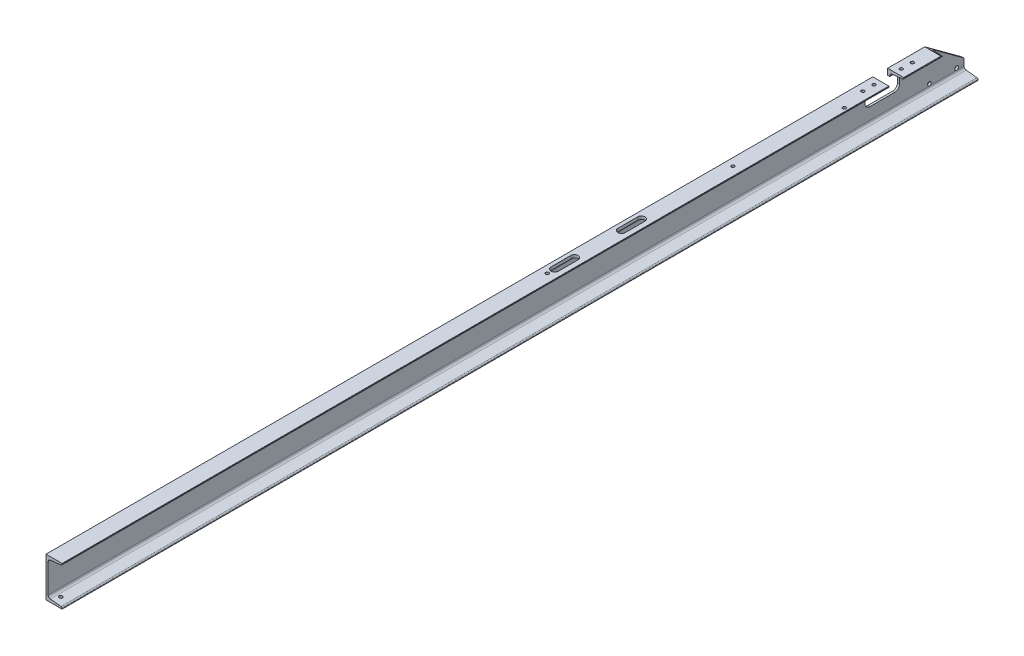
from build123d import *

# Parameters (mm, degrees)
EXTRUDE_1_DEPTH        = 1850
SKETCH_2_R             = 7.5
SKETCH_2_R_2           = 6.5
CUT_EXTRUDE_1_DEPTH    = 1853.869396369
SKETCH_3_R             = 6.5
CUT_EXTRUDE_2_DEPTH    = 20
SKETCH_4_R             = 6.5
CUT_EXTRUDE_3_DEPTH    = 20
PATTERN_LINEAR_1_COUNT = 10
PATTERN_LINEAR_1_PITCH = 200
SKETCH_5_R             = 6.5
CUT_EXTRUDE_4_DEPTH    = 15
SKETCH_6_R             = 6.5
CUT_EXTRUDE_5_DEPTH    = 20


with BuildPart() as part:
    # Sketch 1 → Extrude 1 (new, symmetric)
    with BuildSketch(Plane.XY):
        with BuildLine():
            Line((65, 80), (0, 80))
            Line((0, 80), (0, -80))
            Line((0, -80), (65, -80))
            Line((65, -80), (65, -77.497140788))
            ThreePointArc((65, -77.497140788), (63.717527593, -74.153491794), (60.528004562, -72.52509783))
            Line((60.528004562, -72.52509783), (17.443990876, -67.949804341))
            ThreePointArc((17.443990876, -67.949804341), (11.064944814, -64.693016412), (8.5, -58.005718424))
            Line((8.5, -58.005718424), (8.5, 58.005718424))
            ThreePointArc((8.5, 58.005718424), (11.064944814, 64.693016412), (17.443990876, 67.949804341))
            Line((17.443990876, 67.949804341), (60.528004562, 72.52509783))
            ThreePointArc((60.528004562, 72.52509783), (63.717527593, 74.153491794), (65, 77.497140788))
            Line((65, 77.497140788), (65, 80))
        make_face()
    extrude(amount=EXTRUDE_1_DEPTH, both=True)

    # Sketch 2 → Cut-Extrude 1 (cut, through all)
    with BuildSketch(Plane.ZY):
        with Locations(Location((-1820, -50, 0), (0, 0, 270))):
            Circle(SKETCH_2_R)
        with Locations(Location((-1710, -50, 0), (0, 0, 270))):
            Circle(SKETCH_2_R)
        with Locations(Location((-1617, 40, 0), (0, 0, 270))):
            Circle(SKETCH_2_R_2)
        with Locations(Location((-1417, 40, 0), (0, 0, 270))):
            Circle(SKETCH_2_R_2)
        with Locations(Location((-1710, 50, 0), (0, 0, 270))):
            Circle(SKETCH_2_R)
        Polygon((-1850, 80), (-1850, -30), (-1700, 80), align=None)
        with BuildLine():
            Line((-1550, 80), (-1550, 55))
            Line((-1550, 55), (-1570, 55))
            ThreePointArc((-1570, 55), (-1584.142135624, 49.142135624), (-1590, 35))
            Line((-1590, 35), (-1590, 10))
            ThreePointArc((-1590, 10), (-1584.142135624, -4.142135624), (-1570, -10))
            Line((-1570, -10), (-1470, -10))
            ThreePointArc((-1470, -10), (-1455.857864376, -4.142135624), (-1450, 10))
            Line((-1450, 10), (-1450, 35))
            ThreePointArc((-1450, 35), (-1455.857864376, 49.142135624), (-1470, 55))
            Line((-1470, 55), (-1490, 55))
            Line((-1490, 55), (-1490, 80))
            Line((-1490, 80), (-1550, 80))
        make_face()
    extrude(amount=-CUT_EXTRUDE_1_DEPTH, mode=Mode.SUBTRACT)

    # Sketch 3 → Cut-Extrude 2 (cut)
    with BuildSketch(Plane(origin=(0, 80, 0), x_dir=(-1, 0, 0), z_dir=(0, 1, 0))):
        with Locations((-30, -1620)):
            Circle(SKETCH_3_R)
        with Locations((-30, -1575)):
            Circle(SKETCH_3_R)
        with Locations((-30, -1465)):
            Circle(SKETCH_3_R)
        with Locations((-30, -1420)):
            Circle(SKETCH_3_R)
        with Locations((-30, -895)):
            Circle(SKETCH_3_R)
        with Locations((-30, -145)):
            Circle(SKETCH_3_R)
    extrude(amount=-CUT_EXTRUDE_2_DEPTH, mode=Mode.SUBTRACT)

    # Sketch 4 → Cut-Extrude 3 (cut)
    with BuildSketch(Plane.ZY):
        with Locations(Location((-920, 29, 0), (0, 0, 270))):
            Circle(SKETCH_4_R)
    cut_extrude_3 = extrude(amount=-CUT_EXTRUDE_3_DEPTH, mode=Mode.SUBTRACT)

    # Pattern Linear 1: Cut-Extrude 3 ×10
    with Locations(*[(0, 0, i * PATTERN_LINEAR_1_PITCH) for i in range(1, PATTERN_LINEAR_1_COUNT)]):
        add(cut_extrude_3, mode=Mode.SUBTRACT)

    # Sketch 5 → Cut-Extrude 4 (cut)
    with BuildSketch(Plane(origin=(0, 80, 0), x_dir=(-1, 0, 0), z_dir=(0, 1, 0))):
        with Locations((-51, -1324)):
            Circle(SKETCH_5_R)
        with BuildLine():
            Line((-45, -445), (-45, -525))
            ThreePointArc((-45, -525), (-30, -540), (-15, -525))
            Line((-15, -525), (-15, -445))
            ThreePointArc((-15, -445), (-30, -430), (-45, -445))
        make_face()
        with BuildLine():
            Line((-45, -175), (-45, -255))
            ThreePointArc((-45, -255), (-30, -270), (-15, -255))
            Line((-15, -255), (-15, -175))
            ThreePointArc((-15, -175), (-30, -160), (-45, -175))
        make_face()
    extrude(amount=-CUT_EXTRUDE_4_DEPTH, mode=Mode.SUBTRACT)

    # Sketch 6 → Cut-Extrude 5 (cut)
    with BuildSketch(Plane.XZ.offset(80)):
        with Locations(Location((30, 1820, 0), (0, 0, 270))):
            Circle(SKETCH_6_R)
    extrude(amount=-CUT_EXTRUDE_5_DEPTH, mode=Mode.SUBTRACT)


solid = part.part
